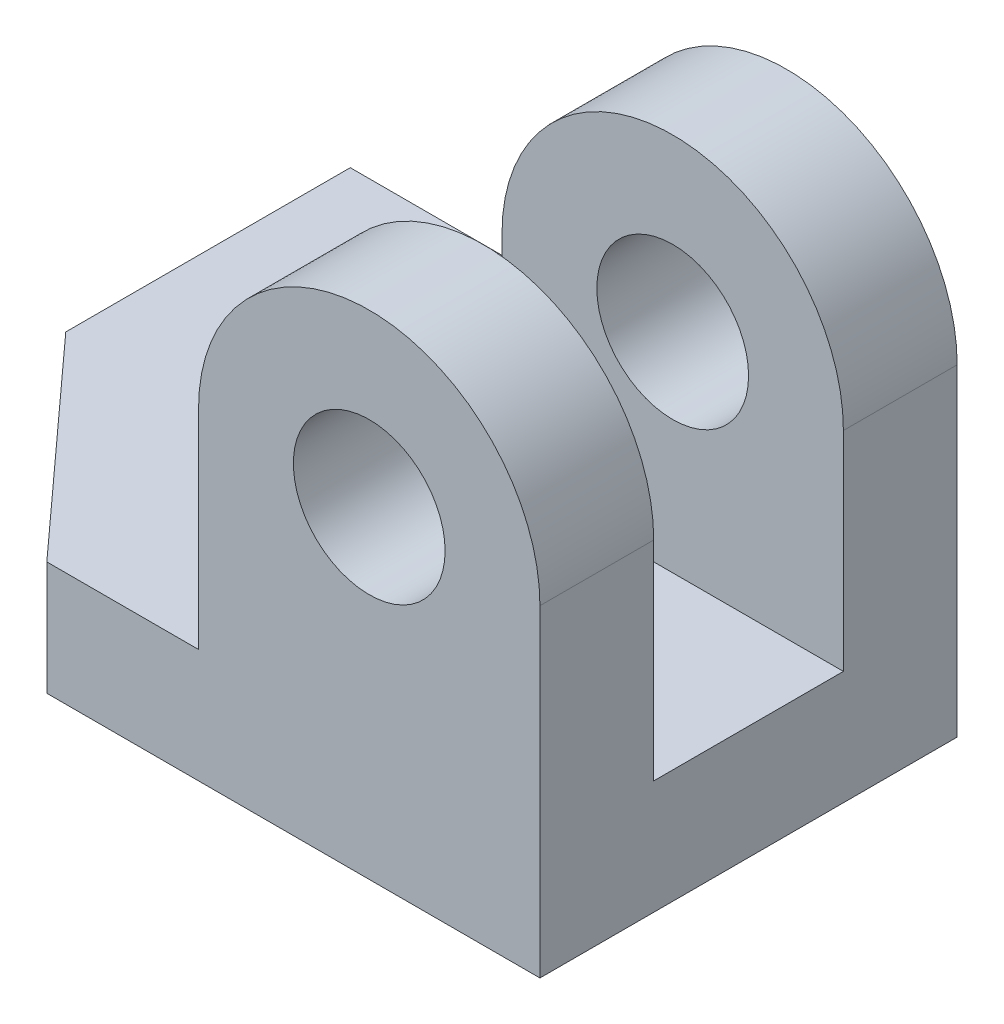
ISO-10303-21;
HEADER;
FILE_DESCRIPTION(('STEP AP214'),'2;1');
FILE_NAME('part.step','',(''),(''),'','','');
FILE_SCHEMA(('AUTOMOTIVE_DESIGN { 1 0 10303 214 1 1 1 1 }'));
ENDSEC;
DATA;
#1=APPLICATION_CONTEXT('core data for automotive mechanical design processes');
#2=APPLICATION_PROTOCOL_DEFINITION('international standard','automotive_design',2000,#1);
#3=PRODUCT_CONTEXT('',#1,'mechanical');
#4=PRODUCT('Part','Part','',(#3));
#5=PRODUCT_RELATED_PRODUCT_CATEGORY('part','',(#4));
#6=PRODUCT_DEFINITION_FORMATION('','',#4);
#7=PRODUCT_DEFINITION_CONTEXT('part definition',#1,'design');
#8=PRODUCT_DEFINITION('design','',#6,#7);
#9=PRODUCT_DEFINITION_SHAPE('','',#8);
#10=(LENGTH_UNIT() NAMED_UNIT(*) SI_UNIT(.MILLI.,.METRE.));
#11=(NAMED_UNIT(*) PLANE_ANGLE_UNIT() SI_UNIT($,.RADIAN.));
#12=(NAMED_UNIT(*) SI_UNIT($,.STERADIAN.) SOLID_ANGLE_UNIT());
#13=UNCERTAINTY_MEASURE_WITH_UNIT(LENGTH_MEASURE(1.E-05),#10,'distance_accuracy_value','');
#14=(GEOMETRIC_REPRESENTATION_CONTEXT(3) GLOBAL_UNCERTAINTY_ASSIGNED_CONTEXT((#13)) GLOBAL_UNIT_ASSIGNED_CONTEXT((#10,
#11,#12)) REPRESENTATION_CONTEXT('',''));
#15=CARTESIAN_POINT('',(0.,0.,0.));
#16=DIRECTION('',(0.,0.,1.));
#17=DIRECTION('',(1.,0.,0.));
#18=AXIS2_PLACEMENT_3D('',#15,#16,#17);
#19=CARTESIAN_POINT('',(67.5,42.5,-40.));
#20=DIRECTION('',(0.,0.,1.));
#21=DIRECTION('',(1.,0.,0.));
#22=AXIS2_PLACEMENT_3D('',#19,#20,#21);
#23=CYLINDRICAL_SURFACE('',#22,22.5);
#24=DIRECTION('',(0.,0.,-1.));
#25=VECTOR('',#24,1.);
#26=CARTESIAN_POINT('',(45.,42.5,-40.));
#27=LINE('',#26,#25);
#28=CARTESIAN_POINT('',(45.,42.5,-40.));
#29=VERTEX_POINT('',#28);
#30=CARTESIAN_POINT('',(45.,42.5,-55.));
#31=VERTEX_POINT('',#30);
#32=EDGE_CURVE('E184',#29,#31,#27,.T.);
#33=ORIENTED_EDGE('',*,*,#32,.F.);
#34=CARTESIAN_POINT('',(67.5,42.5,-40.));
#35=DIRECTION('',(0.,0.,-1.));
#36=DIRECTION('',(-1.,0.,0.));
#37=AXIS2_PLACEMENT_3D('',#34,#35,#36);
#38=CIRCLE('',#37,22.5);
#39=CARTESIAN_POINT('',(90.,42.5,-40.));
#40=VERTEX_POINT('',#39);
#41=EDGE_CURVE('E39',#40,#29,#38,.F.);
#42=ORIENTED_EDGE('',*,*,#41,.F.);
#43=DIRECTION('',(0.,0.,-1.));
#44=VECTOR('',#43,1.);
#45=CARTESIAN_POINT('',(90.,42.5,-40.));
#46=LINE('',#45,#44);
#47=CARTESIAN_POINT('',(90.,42.5,-55.));
#48=VERTEX_POINT('',#47);
#49=EDGE_CURVE('E129',#48,#40,#46,.F.);
#50=ORIENTED_EDGE('',*,*,#49,.F.);
#51=CARTESIAN_POINT('',(67.5,42.5,-55.));
#52=DIRECTION('',(0.,0.,1.));
#53=DIRECTION('',(1.,0.,0.));
#54=AXIS2_PLACEMENT_3D('',#51,#52,#53);
#55=CIRCLE('',#54,22.5);
#56=EDGE_CURVE('E11',#31,#48,#55,.F.);
#57=ORIENTED_EDGE('',*,*,#56,.F.);
#58=EDGE_LOOP('',(#33,#42,#50,#57));
#59=FACE_BOUND('',#58,.T.);
#60=ADVANCED_FACE('F31',(#59),#23,.T.);
#61=CARTESIAN_POINT('',(67.5,42.5,-15.));
#62=DIRECTION('',(0.,0.,-1.));
#63=DIRECTION('',(-1.,0.,0.));
#64=AXIS2_PLACEMENT_3D('',#61,#62,#63);
#65=CYLINDRICAL_SURFACE('',#64,22.5);
#66=DIRECTION('',(0.,0.,1.));
#67=VECTOR('',#66,1.);
#68=CARTESIAN_POINT('',(90.,42.5,-15.));
#69=LINE('',#68,#67);
#70=CARTESIAN_POINT('',(90.,42.5,-15.));
#71=VERTEX_POINT('',#70);
#72=CARTESIAN_POINT('',(90.,42.5,0.));
#73=VERTEX_POINT('',#72);
#74=EDGE_CURVE('E174',#71,#73,#69,.T.);
#75=ORIENTED_EDGE('',*,*,#74,.F.);
#76=CARTESIAN_POINT('',(67.5,42.5,-15.));
#77=DIRECTION('',(0.,0.,1.));
#78=DIRECTION('',(1.,0.,0.));
#79=AXIS2_PLACEMENT_3D('',#76,#77,#78);
#80=CIRCLE('',#79,22.5);
#81=CARTESIAN_POINT('',(45.,42.5,-15.));
#82=VERTEX_POINT('',#81);
#83=EDGE_CURVE('E181',#82,#71,#80,.F.);
#84=ORIENTED_EDGE('',*,*,#83,.F.);
#85=DIRECTION('',(0.,0.,1.));
#86=VECTOR('',#85,1.);
#87=CARTESIAN_POINT('',(45.,42.5,-15.));
#88=LINE('',#87,#86);
#89=CARTESIAN_POINT('',(45.,42.5,0.));
#90=VERTEX_POINT('',#89);
#91=EDGE_CURVE('E177',#90,#82,#88,.F.);
#92=ORIENTED_EDGE('',*,*,#91,.F.);
#93=CARTESIAN_POINT('',(67.5,42.5,0.));
#94=DIRECTION('',(0.,0.,-1.));
#95=DIRECTION('',(-1.,0.,0.));
#96=AXIS2_PLACEMENT_3D('',#93,#94,#95);
#97=CIRCLE('',#96,22.5);
#98=EDGE_CURVE('E183',#73,#90,#97,.F.);
#99=ORIENTED_EDGE('',*,*,#98,.F.);
#100=EDGE_LOOP('',(#75,#84,#92,#99));
#101=FACE_BOUND('',#100,.T.);
#102=ADVANCED_FACE('F275',(#101),#65,.T.);
#103=CARTESIAN_POINT('',(90.,15.,-55.));
#104=DIRECTION('',(0.,-1.,0.));
#105=DIRECTION('',(0.,0.,-1.));
#106=AXIS2_PLACEMENT_3D('',#103,#104,#105);
#107=PLANE('',#106);
#108=DIRECTION('',(-1.,0.,0.));
#109=VECTOR('',#108,1.);
#110=CARTESIAN_POINT('',(45.,15.,-15.));
#111=LINE('',#110,#109);
#112=CARTESIAN_POINT('',(90.,15.,-15.));
#113=VERTEX_POINT('',#112);
#114=CARTESIAN_POINT('',(45.,15.,-15.));
#115=VERTEX_POINT('',#114);
#116=EDGE_CURVE('E144',#113,#115,#111,.T.);
#117=ORIENTED_EDGE('',*,*,#116,.F.);
#118=DIRECTION('',(0.,0.,-1.));
#119=VECTOR('',#118,1.);
#120=CARTESIAN_POINT('',(90.,15.,0.));
#121=LINE('',#120,#119);
#122=CARTESIAN_POINT('',(90.,15.,-40.));
#123=VERTEX_POINT('',#122);
#124=EDGE_CURVE('E128',#113,#123,#121,.T.);
#125=ORIENTED_EDGE('',*,*,#124,.T.);
#126=DIRECTION('',(1.,0.,0.));
#127=VECTOR('',#126,1.);
#128=CARTESIAN_POINT('',(45.,15.,-40.));
#129=LINE('',#128,#127);
#130=CARTESIAN_POINT('',(45.,15.,-40.));
#131=VERTEX_POINT('',#130);
#132=EDGE_CURVE('E140',#131,#123,#129,.T.);
#133=ORIENTED_EDGE('',*,*,#132,.F.);
#134=DIRECTION('',(0.,0.,1.));
#135=VECTOR('',#134,1.);
#136=CARTESIAN_POINT('',(45.,15.,-55.));
#137=LINE('',#136,#135);
#138=CARTESIAN_POINT('',(45.,15.,-55.));
#139=VERTEX_POINT('',#138);
#140=EDGE_CURVE('E150',#139,#131,#137,.T.);
#141=ORIENTED_EDGE('',*,*,#140,.F.);
#142=DIRECTION('',(-1.,0.,0.));
#143=VECTOR('',#142,1.);
#144=CARTESIAN_POINT('',(25.,15.,-55.));
#145=LINE('',#144,#143);
#146=CARTESIAN_POINT('',(25.,15.,-55.));
#147=VERTEX_POINT('',#146);
#148=EDGE_CURVE('E145',#139,#147,#145,.T.);
#149=ORIENTED_EDGE('',*,*,#148,.T.);
#150=DIRECTION('',(0.,0.,-1.));
#151=VECTOR('',#150,1.);
#152=CARTESIAN_POINT('',(25.,15.,-65.));
#153=LINE('',#152,#151);
#154=CARTESIAN_POINT('',(25.,15.,-65.));
#155=VERTEX_POINT('',#154);
#156=EDGE_CURVE('E197',#147,#155,#153,.T.);
#157=ORIENTED_EDGE('',*,*,#156,.T.);
#158=DIRECTION('',(-1.,0.,0.));
#159=VECTOR('',#158,1.);
#160=CARTESIAN_POINT('',(0.,15.,-65.));
#161=LINE('',#160,#159);
#162=CARTESIAN_POINT('',(0.,15.,-65.));
#163=VERTEX_POINT('',#162);
#164=EDGE_CURVE('E198',#155,#163,#161,.T.);
#165=ORIENTED_EDGE('',*,*,#164,.T.);
#166=DIRECTION('',(0.,0.,1.));
#167=VECTOR('',#166,1.);
#168=CARTESIAN_POINT('',(0.,15.,-55.));
#169=LINE('',#168,#167);
#170=CARTESIAN_POINT('',(0.,15.,-27.5));
#171=VERTEX_POINT('',#170);
#172=EDGE_CURVE('E200',#163,#171,#169,.T.);
#173=ORIENTED_EDGE('',*,*,#172,.T.);
#174=DIRECTION('',(0.672672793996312,0.,0.739940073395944));
#175=VECTOR('',#174,1.);
#176=CARTESIAN_POINT('',(0.,15.,-27.5));
#177=LINE('',#176,#175);
#178=CARTESIAN_POINT('',(25.,15.,0.));
#179=VERTEX_POINT('',#178);
#180=EDGE_CURVE('E204',#171,#179,#177,.T.);
#181=ORIENTED_EDGE('',*,*,#180,.T.);
#182=DIRECTION('',(1.,0.,0.));
#183=VECTOR('',#182,1.);
#184=CARTESIAN_POINT('',(25.,15.,0.));
#185=LINE('',#184,#183);
#186=CARTESIAN_POINT('',(45.,15.,0.));
#187=VERTEX_POINT('',#186);
#188=EDGE_CURVE('E206',#179,#187,#185,.T.);
#189=ORIENTED_EDGE('',*,*,#188,.T.);
#190=DIRECTION('',(0.,0.,1.));
#191=VECTOR('',#190,1.);
#192=CARTESIAN_POINT('',(45.,15.,0.));
#193=LINE('',#192,#191);
#194=EDGE_CURVE('E431',#115,#187,#193,.T.);
#195=ORIENTED_EDGE('',*,*,#194,.F.);
#196=EDGE_LOOP('',(#117,#125,#133,#141,#149,#157,#165,#173,#181,#189,#195));
#197=FACE_BOUND('',#196,.T.);
#198=ADVANCED_FACE('F138',(#197),#107,.F.);
#199=CARTESIAN_POINT('',(90.,15.,0.));
#200=DIRECTION('',(-1.,0.,0.));
#201=DIRECTION('',(0.,0.,1.));
#202=AXIS2_PLACEMENT_3D('',#199,#200,#201);
#203=PLANE('',#202);
#204=DIRECTION('',(0.,-1.,0.));
#205=VECTOR('',#204,1.);
#206=CARTESIAN_POINT('',(90.,15.,-55.));
#207=LINE('',#206,#205);
#208=CARTESIAN_POINT('',(90.,0.,-55.));
#209=VERTEX_POINT('',#208);
#210=EDGE_CURVE('E178',#48,#209,#207,.T.);
#211=ORIENTED_EDGE('',*,*,#210,.F.);
#212=ORIENTED_EDGE('',*,*,#49,.T.);
#213=DIRECTION('',(0.,-1.,0.));
#214=VECTOR('',#213,1.);
#215=CARTESIAN_POINT('',(90.,65.,-40.));
#216=LINE('',#215,#214);
#217=EDGE_CURVE('E123',#40,#123,#216,.T.);
#218=ORIENTED_EDGE('',*,*,#217,.T.);
#219=ORIENTED_EDGE('',*,*,#124,.F.);
#220=DIRECTION('',(0.,-1.,0.));
#221=VECTOR('',#220,1.);
#222=CARTESIAN_POINT('',(90.,65.,-15.));
#223=LINE('',#222,#221);
#224=EDGE_CURVE('E153',#71,#113,#223,.T.);
#225=ORIENTED_EDGE('',*,*,#224,.F.);
#226=ORIENTED_EDGE('',*,*,#74,.T.);
#227=DIRECTION('',(0.,-1.,0.));
#228=VECTOR('',#227,1.);
#229=CARTESIAN_POINT('',(90.,15.,0.));
#230=LINE('',#229,#228);
#231=CARTESIAN_POINT('',(90.,0.,0.));
#232=VERTEX_POINT('',#231);
#233=EDGE_CURVE('E209',#73,#232,#230,.T.);
#234=ORIENTED_EDGE('',*,*,#233,.T.);
#235=DIRECTION('',(0.,0.,-1.));
#236=VECTOR('',#235,1.);
#237=CARTESIAN_POINT('',(90.,0.,0.));
#238=LINE('',#237,#236);
#239=EDGE_CURVE('E166',#232,#209,#238,.T.);
#240=ORIENTED_EDGE('',*,*,#239,.T.);
#241=EDGE_LOOP('',(#211,#212,#218,#219,#225,#226,#234,#240));
#242=FACE_BOUND('',#241,.T.);
#243=ADVANCED_FACE('F126',(#242),#203,.F.);
#244=CARTESIAN_POINT('',(25.,15.,-55.));
#245=DIRECTION('',(0.,0.,1.));
#246=DIRECTION('',(1.,0.,0.));
#247=AXIS2_PLACEMENT_3D('',#244,#245,#246);
#248=PLANE('',#247);
#249=CARTESIAN_POINT('',(67.5,42.5,-55.));
#250=DIRECTION('',(0.,0.,1.));
#251=DIRECTION('',(1.,0.,0.));
#252=AXIS2_PLACEMENT_3D('',#249,#250,#251);
#253=CIRCLE('',#252,9.99999999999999);
#254=CARTESIAN_POINT('',(77.5,42.5,-55.));
#255=VERTEX_POINT('',#254);
#256=EDGE_CURVE('E437',#255,#255,#253,.T.);
#257=ORIENTED_EDGE('',*,*,#256,.T.);
#258=EDGE_LOOP('',(#257));
#259=FACE_BOUND('',#258,.T.);
#260=DIRECTION('',(0.,-1.,0.));
#261=VECTOR('',#260,1.);
#262=CARTESIAN_POINT('',(45.,65.,-55.));
#263=LINE('',#262,#261);
#264=EDGE_CURVE('E133',#31,#139,#263,.T.);
#265=ORIENTED_EDGE('',*,*,#264,.F.);
#266=ORIENTED_EDGE('',*,*,#56,.T.);
#267=ORIENTED_EDGE('',*,*,#210,.T.);
#268=DIRECTION('',(-1.,0.,0.));
#269=VECTOR('',#268,1.);
#270=CARTESIAN_POINT('',(25.,0.,-55.));
#271=LINE('',#270,#269);
#272=CARTESIAN_POINT('',(25.,0.,-55.));
#273=VERTEX_POINT('',#272);
#274=EDGE_CURVE('E212',#209,#273,#271,.T.);
#275=ORIENTED_EDGE('',*,*,#274,.T.);
#276=DIRECTION('',(0.,-1.,0.));
#277=VECTOR('',#276,1.);
#278=CARTESIAN_POINT('',(25.,15.,-55.));
#279=LINE('',#278,#277);
#280=EDGE_CURVE('E195',#147,#273,#279,.T.);
#281=ORIENTED_EDGE('',*,*,#280,.F.);
#282=ORIENTED_EDGE('',*,*,#148,.F.);
#283=EDGE_LOOP('',(#265,#266,#267,#275,#281,#282));
#284=FACE_BOUND('',#283,.T.);
#285=ADVANCED_FACE('F193',(#259,#284),#248,.F.);
#286=CARTESIAN_POINT('',(25.,15.,-65.));
#287=DIRECTION('',(-1.,0.,0.));
#288=DIRECTION('',(0.,0.,1.));
#289=AXIS2_PLACEMENT_3D('',#286,#287,#288);
#290=PLANE('',#289);
#291=DIRECTION('',(0.,0.,-1.));
#292=VECTOR('',#291,1.);
#293=CARTESIAN_POINT('',(25.,0.,-65.));
#294=LINE('',#293,#292);
#295=CARTESIAN_POINT('',(25.,0.,-65.));
#296=VERTEX_POINT('',#295);
#297=EDGE_CURVE('E214',#273,#296,#294,.T.);
#298=ORIENTED_EDGE('',*,*,#297,.T.);
#299=DIRECTION('',(0.,-1.,0.));
#300=VECTOR('',#299,1.);
#301=CARTESIAN_POINT('',(25.,15.,-65.));
#302=LINE('',#301,#300);
#303=EDGE_CURVE('E235',#155,#296,#302,.T.);
#304=ORIENTED_EDGE('',*,*,#303,.F.);
#305=ORIENTED_EDGE('',*,*,#156,.F.);
#306=ORIENTED_EDGE('',*,*,#280,.T.);
#307=EDGE_LOOP('',(#298,#304,#305,#306));
#308=FACE_BOUND('',#307,.T.);
#309=ADVANCED_FACE('F264',(#308),#290,.F.);
#310=CARTESIAN_POINT('',(0.,15.,-65.));
#311=DIRECTION('',(0.,0.,1.));
#312=DIRECTION('',(1.,0.,0.));
#313=AXIS2_PLACEMENT_3D('',#310,#311,#312);
#314=PLANE('',#313);
#315=DIRECTION('',(-1.,0.,0.));
#316=VECTOR('',#315,1.);
#317=CARTESIAN_POINT('',(0.,0.,-65.));
#318=LINE('',#317,#316);
#319=CARTESIAN_POINT('',(0.,0.,-65.));
#320=VERTEX_POINT('',#319);
#321=EDGE_CURVE('E216',#296,#320,#318,.T.);
#322=ORIENTED_EDGE('',*,*,#321,.T.);
#323=DIRECTION('',(0.,-1.,0.));
#324=VECTOR('',#323,1.);
#325=CARTESIAN_POINT('',(0.,15.,-65.));
#326=LINE('',#325,#324);
#327=EDGE_CURVE('E232',#163,#320,#326,.T.);
#328=ORIENTED_EDGE('',*,*,#327,.F.);
#329=ORIENTED_EDGE('',*,*,#164,.F.);
#330=ORIENTED_EDGE('',*,*,#303,.T.);
#331=EDGE_LOOP('',(#322,#328,#329,#330));
#332=FACE_BOUND('',#331,.T.);
#333=ADVANCED_FACE('F262',(#332),#314,.F.);
#334=CARTESIAN_POINT('',(0.,15.,-27.5));
#335=DIRECTION('',(1.,0.,0.));
#336=DIRECTION('',(0.,0.,-1.));
#337=AXIS2_PLACEMENT_3D('',#334,#335,#336);
#338=PLANE('',#337);
#339=DIRECTION('',(0.,0.,1.));
#340=VECTOR('',#339,1.);
#341=CARTESIAN_POINT('',(0.,0.,-27.5));
#342=LINE('',#341,#340);
#343=CARTESIAN_POINT('',(0.,0.,-27.5));
#344=VERTEX_POINT('',#343);
#345=EDGE_CURVE('E219',#320,#344,#342,.T.);
#346=ORIENTED_EDGE('',*,*,#345,.T.);
#347=DIRECTION('',(0.,-1.,0.));
#348=VECTOR('',#347,1.);
#349=CARTESIAN_POINT('',(0.,15.,-27.5));
#350=LINE('',#349,#348);
#351=EDGE_CURVE('E229',#171,#344,#350,.T.);
#352=ORIENTED_EDGE('',*,*,#351,.F.);
#353=ORIENTED_EDGE('',*,*,#172,.F.);
#354=ORIENTED_EDGE('',*,*,#327,.T.);
#355=EDGE_LOOP('',(#346,#352,#353,#354));
#356=FACE_BOUND('',#355,.T.);
#357=ADVANCED_FACE('F258',(#356),#338,.F.);
#358=CARTESIAN_POINT('',(0.,15.,-27.5));
#359=DIRECTION('',(0.739940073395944,0.,-0.672672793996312));
#360=DIRECTION('',(-0.672672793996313,0.,-0.739940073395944));
#361=AXIS2_PLACEMENT_3D('',#358,#359,#360);
#362=PLANE('',#361);
#363=DIRECTION('',(0.672672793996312,0.,0.739940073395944));
#364=VECTOR('',#363,1.);
#365=CARTESIAN_POINT('',(0.,0.,-27.5));
#366=LINE('',#365,#364);
#367=CARTESIAN_POINT('',(25.,0.,0.));
#368=VERTEX_POINT('',#367);
#369=EDGE_CURVE('E221',#344,#368,#366,.T.);
#370=ORIENTED_EDGE('',*,*,#369,.T.);
#371=DIRECTION('',(0.,-1.,0.));
#372=VECTOR('',#371,1.);
#373=CARTESIAN_POINT('',(25.,15.,0.));
#374=LINE('',#373,#372);
#375=EDGE_CURVE('E226',#179,#368,#374,.T.);
#376=ORIENTED_EDGE('',*,*,#375,.F.);
#377=ORIENTED_EDGE('',*,*,#180,.F.);
#378=ORIENTED_EDGE('',*,*,#351,.T.);
#379=EDGE_LOOP('',(#370,#376,#377,#378));
#380=FACE_BOUND('',#379,.T.);
#381=ADVANCED_FACE('F253',(#380),#362,.F.);
#382=CARTESIAN_POINT('',(25.,15.,0.));
#383=DIRECTION('',(0.,0.,-1.));
#384=DIRECTION('',(-1.,0.,0.));
#385=AXIS2_PLACEMENT_3D('',#382,#383,#384);
#386=PLANE('',#385);
#387=CARTESIAN_POINT('',(67.5,42.5,0.));
#388=DIRECTION('',(0.,0.,1.));
#389=DIRECTION('',(1.,0.,0.));
#390=AXIS2_PLACEMENT_3D('',#387,#388,#389);
#391=CIRCLE('',#390,9.99999999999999);
#392=CARTESIAN_POINT('',(77.5,42.5,0.));
#393=VERTEX_POINT('',#392);
#394=EDGE_CURVE('E443',#393,#393,#391,.T.);
#395=ORIENTED_EDGE('',*,*,#394,.F.);
#396=EDGE_LOOP('',(#395));
#397=FACE_BOUND('',#396,.T.);
#398=ORIENTED_EDGE('',*,*,#233,.F.);
#399=ORIENTED_EDGE('',*,*,#98,.T.);
#400=DIRECTION('',(0.,-1.,0.));
#401=VECTOR('',#400,1.);
#402=CARTESIAN_POINT('',(45.,65.,0.));
#403=LINE('',#402,#401);
#404=EDGE_CURVE('E428',#90,#187,#403,.T.);
#405=ORIENTED_EDGE('',*,*,#404,.T.);
#406=ORIENTED_EDGE('',*,*,#188,.F.);
#407=ORIENTED_EDGE('',*,*,#375,.T.);
#408=DIRECTION('',(1.,0.,0.));
#409=VECTOR('',#408,1.);
#410=CARTESIAN_POINT('',(25.,0.,0.));
#411=LINE('',#410,#409);
#412=EDGE_CURVE('E146',#368,#232,#411,.T.);
#413=ORIENTED_EDGE('',*,*,#412,.T.);
#414=EDGE_LOOP('',(#398,#399,#405,#406,#407,#413));
#415=FACE_BOUND('',#414,.T.);
#416=ADVANCED_FACE('F248',(#397,#415),#386,.F.);
#417=CARTESIAN_POINT('',(90.,0.,-55.));
#418=DIRECTION('',(0.,-1.,0.));
#419=DIRECTION('',(0.,0.,-1.));
#420=AXIS2_PLACEMENT_3D('',#417,#418,#419);
#421=PLANE('',#420);
#422=ORIENTED_EDGE('',*,*,#239,.F.);
#423=ORIENTED_EDGE('',*,*,#412,.F.);
#424=ORIENTED_EDGE('',*,*,#369,.F.);
#425=ORIENTED_EDGE('',*,*,#345,.F.);
#426=ORIENTED_EDGE('',*,*,#321,.F.);
#427=ORIENTED_EDGE('',*,*,#297,.F.);
#428=ORIENTED_EDGE('',*,*,#274,.F.);
#429=EDGE_LOOP('',(#422,#423,#424,#425,#426,#427,#428));
#430=FACE_BOUND('',#429,.T.);
#431=ADVANCED_FACE('F242',(#430),#421,.T.);
#432=CARTESIAN_POINT('',(45.,65.,-55.));
#433=DIRECTION('',(1.,0.,0.));
#434=DIRECTION('',(0.,0.,-1.));
#435=AXIS2_PLACEMENT_3D('',#432,#433,#434);
#436=PLANE('',#435);
#437=DIRECTION('',(0.,-1.,0.));
#438=VECTOR('',#437,1.);
#439=CARTESIAN_POINT('',(45.,65.,-40.));
#440=LINE('',#439,#438);
#441=EDGE_CURVE('E132',#29,#131,#440,.T.);
#442=ORIENTED_EDGE('',*,*,#441,.F.);
#443=ORIENTED_EDGE('',*,*,#32,.T.);
#444=ORIENTED_EDGE('',*,*,#264,.T.);
#445=ORIENTED_EDGE('',*,*,#140,.T.);
#446=EDGE_LOOP('',(#442,#443,#444,#445));
#447=FACE_BOUND('',#446,.T.);
#448=ADVANCED_FACE('F190',(#447),#436,.F.);
#449=CARTESIAN_POINT('',(45.,65.,-40.));
#450=DIRECTION('',(0.,0.,-1.));
#451=DIRECTION('',(-1.,0.,0.));
#452=AXIS2_PLACEMENT_3D('',#449,#450,#451);
#453=PLANE('',#452);
#454=CARTESIAN_POINT('',(67.5,42.5,-40.));
#455=DIRECTION('',(0.,0.,-1.));
#456=DIRECTION('',(-1.,0.,0.));
#457=AXIS2_PLACEMENT_3D('',#454,#455,#456);
#458=CIRCLE('',#457,9.99999999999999);
#459=CARTESIAN_POINT('',(57.5,42.5,-40.));
#460=VERTEX_POINT('',#459);
#461=EDGE_CURVE('E440',#460,#460,#458,.T.);
#462=ORIENTED_EDGE('',*,*,#461,.T.);
#463=EDGE_LOOP('',(#462));
#464=FACE_BOUND('',#463,.T.);
#465=ORIENTED_EDGE('',*,*,#217,.F.);
#466=ORIENTED_EDGE('',*,*,#41,.T.);
#467=ORIENTED_EDGE('',*,*,#441,.T.);
#468=ORIENTED_EDGE('',*,*,#132,.T.);
#469=EDGE_LOOP('',(#465,#466,#467,#468));
#470=FACE_BOUND('',#469,.T.);
#471=ADVANCED_FACE('F148',(#464,#470),#453,.F.);
#472=CARTESIAN_POINT('',(45.,65.,-15.));
#473=DIRECTION('',(0.,0.,1.));
#474=DIRECTION('',(1.,0.,0.));
#475=AXIS2_PLACEMENT_3D('',#472,#473,#474);
#476=PLANE('',#475);
#477=CARTESIAN_POINT('',(67.5,42.5,-15.));
#478=DIRECTION('',(0.,0.,1.));
#479=DIRECTION('',(1.,0.,0.));
#480=AXIS2_PLACEMENT_3D('',#477,#478,#479);
#481=CIRCLE('',#480,9.99999999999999);
#482=CARTESIAN_POINT('',(77.5,42.5,-15.));
#483=VERTEX_POINT('',#482);
#484=EDGE_CURVE('E34',#483,#483,#481,.T.);
#485=ORIENTED_EDGE('',*,*,#484,.T.);
#486=EDGE_LOOP('',(#485));
#487=FACE_BOUND('',#486,.T.);
#488=DIRECTION('',(0.,-1.,0.));
#489=VECTOR('',#488,1.);
#490=CARTESIAN_POINT('',(45.,65.,-15.));
#491=LINE('',#490,#489);
#492=EDGE_CURVE('E432',#82,#115,#491,.T.);
#493=ORIENTED_EDGE('',*,*,#492,.F.);
#494=ORIENTED_EDGE('',*,*,#83,.T.);
#495=ORIENTED_EDGE('',*,*,#224,.T.);
#496=ORIENTED_EDGE('',*,*,#116,.T.);
#497=EDGE_LOOP('',(#493,#494,#495,#496));
#498=FACE_BOUND('',#497,.T.);
#499=ADVANCED_FACE('F320',(#487,#498),#476,.F.);
#500=CARTESIAN_POINT('',(45.,65.,0.));
#501=DIRECTION('',(1.,0.,0.));
#502=DIRECTION('',(0.,0.,-1.));
#503=AXIS2_PLACEMENT_3D('',#500,#501,#502);
#504=PLANE('',#503);
#505=ORIENTED_EDGE('',*,*,#404,.F.);
#506=ORIENTED_EDGE('',*,*,#91,.T.);
#507=ORIENTED_EDGE('',*,*,#492,.T.);
#508=ORIENTED_EDGE('',*,*,#194,.T.);
#509=EDGE_LOOP('',(#505,#506,#507,#508));
#510=FACE_BOUND('',#509,.T.);
#511=ADVANCED_FACE('F330',(#510),#504,.F.);
#512=CARTESIAN_POINT('',(67.5,42.5,-65.));
#513=DIRECTION('',(0.,0.,1.));
#514=DIRECTION('',(1.,0.,0.));
#515=AXIS2_PLACEMENT_3D('',#512,#513,#514);
#516=CYLINDRICAL_SURFACE('',#515,9.99999999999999);
#517=ORIENTED_EDGE('',*,*,#394,.T.);
#518=EDGE_LOOP('',(#517));
#519=FACE_BOUND('',#518,.T.);
#520=ORIENTED_EDGE('',*,*,#484,.F.);
#521=EDGE_LOOP('',(#520));
#522=FACE_BOUND('',#521,.T.);
#523=ADVANCED_FACE('F338',(#519,#522),#516,.F.);
#524=ORIENTED_EDGE('',*,*,#461,.F.);
#525=EDGE_LOOP('',(#524));
#526=FACE_BOUND('',#525,.T.);
#527=ORIENTED_EDGE('',*,*,#256,.F.);
#528=EDGE_LOOP('',(#527));
#529=FACE_BOUND('',#528,.T.);
#530=ADVANCED_FACE('F343',(#526,#529),#516,.F.);
#531=CLOSED_SHELL('',(#60,#102,#198,#243,#285,#309,#333,#357,#381,#416,#431,#448,#471,#499,#511,
#523,#530));
#532=MANIFOLD_SOLID_BREP('B2',#531);
#533=ADVANCED_BREP_SHAPE_REPRESENTATION('',(#18,#532),#14);
#534=SHAPE_DEFINITION_REPRESENTATION(#9,#533);
ENDSEC;
END-ISO-10303-21;
